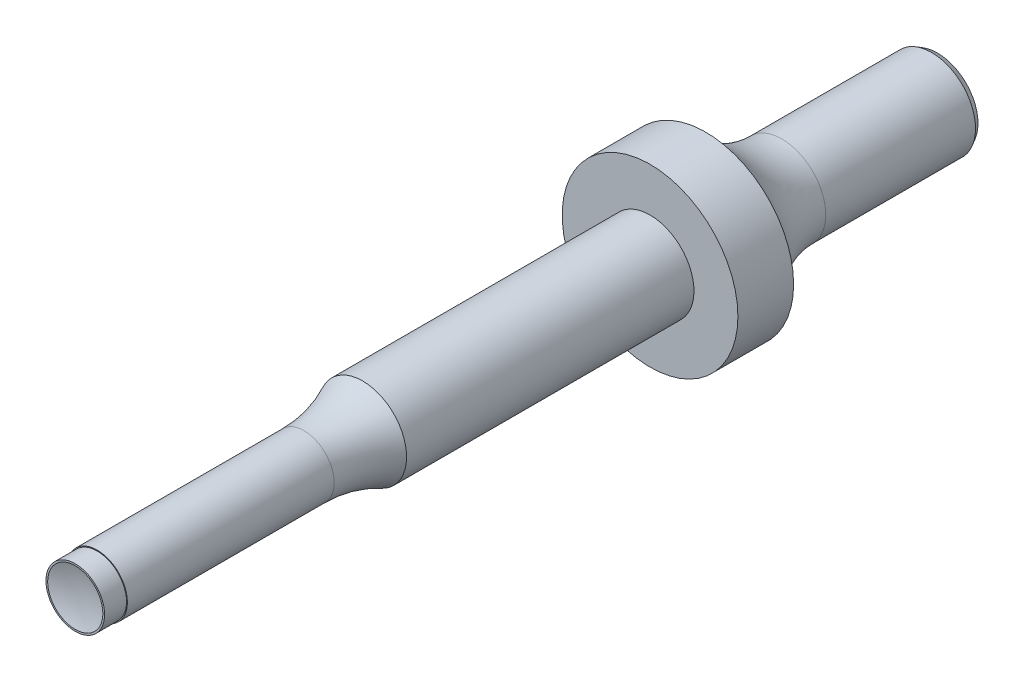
ISO-10303-21;
HEADER;
FILE_DESCRIPTION(('STEP AP214'),'2;1');
FILE_NAME('part.step','',(''),(''),'','','');
FILE_SCHEMA(('AUTOMOTIVE_DESIGN { 1 0 10303 214 1 1 1 1 }'));
ENDSEC;
DATA;
#1=APPLICATION_CONTEXT('core data for automotive mechanical design processes');
#2=APPLICATION_PROTOCOL_DEFINITION('international standard','automotive_design',2000,#1);
#3=PRODUCT_CONTEXT('',#1,'mechanical');
#4=PRODUCT('Part','Part','',(#3));
#5=PRODUCT_RELATED_PRODUCT_CATEGORY('part','',(#4));
#6=PRODUCT_DEFINITION_FORMATION('','',#4);
#7=PRODUCT_DEFINITION_CONTEXT('part definition',#1,'design');
#8=PRODUCT_DEFINITION('design','',#6,#7);
#9=PRODUCT_DEFINITION_SHAPE('','',#8);
#10=(LENGTH_UNIT() NAMED_UNIT(*) SI_UNIT(.MILLI.,.METRE.));
#11=(NAMED_UNIT(*) PLANE_ANGLE_UNIT() SI_UNIT($,.RADIAN.));
#12=(NAMED_UNIT(*) SI_UNIT($,.STERADIAN.) SOLID_ANGLE_UNIT());
#13=UNCERTAINTY_MEASURE_WITH_UNIT(LENGTH_MEASURE(1.E-05),#10,'distance_accuracy_value','');
#14=(GEOMETRIC_REPRESENTATION_CONTEXT(3) GLOBAL_UNCERTAINTY_ASSIGNED_CONTEXT((#13)) GLOBAL_UNIT_ASSIGNED_CONTEXT((#10,
#11,#12)) REPRESENTATION_CONTEXT('',''));
#15=CARTESIAN_POINT('',(0.,0.,0.));
#16=DIRECTION('',(0.,0.,1.));
#17=DIRECTION('',(1.,0.,0.));
#18=AXIS2_PLACEMENT_3D('',#15,#16,#17);
#19=CARTESIAN_POINT('',(0.,0.,-100.));
#20=DIRECTION('',(0.,0.,1.));
#21=DIRECTION('',(1.,0.,0.));
#22=AXIS2_PLACEMENT_3D('',#19,#20,#21);
#23=CYLINDRICAL_SURFACE('',#22,5.095);
#24=CARTESIAN_POINT('',(0.,0.,-33.3333333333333));
#25=DIRECTION('',(0.,0.,-1.));
#26=DIRECTION('',(0.,1.,0.));
#27=AXIS2_PLACEMENT_3D('',#24,#25,#26);
#28=CIRCLE('',#27,5.095);
#29=CARTESIAN_POINT('',(0.,5.095,-33.3333333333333));
#30=VERTEX_POINT('',#29);
#31=EDGE_CURVE('E76',#30,#30,#28,.T.);
#32=ORIENTED_EDGE('',*,*,#31,.T.);
#33=EDGE_LOOP('',(#32));
#34=FACE_BOUND('',#33,.T.);
#35=CARTESIAN_POINT('',(0.,0.,-66.6666666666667));
#36=DIRECTION('',(0.,0.,-1.));
#37=DIRECTION('',(-1.,0.,0.));
#38=AXIS2_PLACEMENT_3D('',#35,#36,#37);
#39=CIRCLE('',#38,5.095);
#40=CARTESIAN_POINT('',(-5.095,0.,-66.6666666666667));
#41=VERTEX_POINT('',#40);
#42=EDGE_CURVE('E44',#41,#41,#39,.F.);
#43=ORIENTED_EDGE('',*,*,#42,.T.);
#44=EDGE_LOOP('',(#43));
#45=FACE_BOUND('',#44,.T.);
#46=ADVANCED_FACE('F40',(#34,#45),#23,.T.);
#47=CARTESIAN_POINT('',(0.,0.,-33.3333333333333));
#48=DIRECTION('',(0.,0.,1.));
#49=DIRECTION('',(1.,0.,0.));
#50=AXIS2_PLACEMENT_3D('',#47,#48,#49);
#51=CYLINDRICAL_SURFACE('',#50,3.5);
#52=CARTESIAN_POINT('',(0.,0.,-26.5351626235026));
#53=DIRECTION('',(0.,0.,1.));
#54=DIRECTION('',(0.,-1.,0.));
#55=AXIS2_PLACEMENT_3D('',#52,#53,#54);
#56=CIRCLE('',#55,3.5);
#57=CARTESIAN_POINT('',(0.,-3.5,-26.5351626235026));
#58=VERTEX_POINT('',#57);
#59=EDGE_CURVE('E12',#58,#58,#56,.F.);
#60=ORIENTED_EDGE('',*,*,#59,.F.);
#61=EDGE_LOOP('',(#60));
#62=FACE_BOUND('',#61,.T.);
#63=CARTESIAN_POINT('',(0.,0.,-2.5475));
#64=DIRECTION('',(0.,0.,1.));
#65=DIRECTION('',(1.,0.,0.));
#66=AXIS2_PLACEMENT_3D('',#63,#64,#65);
#67=CIRCLE('',#66,3.5);
#68=CARTESIAN_POINT('',(3.5,0.,-2.5475));
#69=VERTEX_POINT('',#68);
#70=EDGE_CURVE('E60',#69,#69,#67,.F.);
#71=ORIENTED_EDGE('',*,*,#70,.T.);
#72=EDGE_LOOP('',(#71));
#73=FACE_BOUND('',#72,.T.);
#74=ADVANCED_FACE('F105',(#62,#73),#51,.T.);
#75=CARTESIAN_POINT('',(0.,0.,-2.5475));
#76=DIRECTION('',(0.,0.,1.));
#77=DIRECTION('',(1.,0.,0.));
#78=AXIS2_PLACEMENT_3D('',#75,#76,#77);
#79=PLANE('',#78);
#80=ORIENTED_EDGE('',*,*,#70,.F.);
#81=EDGE_LOOP('',(#80));
#82=FACE_BOUND('',#81,.T.);
#83=CARTESIAN_POINT('',(0.,0.,-2.5475));
#84=DIRECTION('',(0.,0.,1.));
#85=DIRECTION('',(1.,0.,0.));
#86=AXIS2_PLACEMENT_3D('',#83,#84,#85);
#87=CIRCLE('',#86,3.4);
#88=CARTESIAN_POINT('',(3.4,0.,-2.5475));
#89=VERTEX_POINT('',#88);
#90=EDGE_CURVE('E64',#89,#89,#87,.T.);
#91=ORIENTED_EDGE('',*,*,#90,.F.);
#92=EDGE_LOOP('',(#91));
#93=FACE_BOUND('',#92,.T.);
#94=ADVANCED_FACE('F110',(#82,#93),#79,.T.);
#95=CARTESIAN_POINT('',(0.,0.,-2.5475));
#96=DIRECTION('',(0.,0.,1.));
#97=DIRECTION('',(1.,0.,0.));
#98=AXIS2_PLACEMENT_3D('',#95,#96,#97);
#99=CYLINDRICAL_SURFACE('',#98,3.4);
#100=CARTESIAN_POINT('',(0.,0.,0.));
#101=DIRECTION('',(0.,0.,1.));
#102=DIRECTION('',(1.,0.,0.));
#103=AXIS2_PLACEMENT_3D('',#100,#101,#102);
#104=CIRCLE('',#103,3.4);
#105=CARTESIAN_POINT('',(3.4,0.,0.));
#106=VERTEX_POINT('',#105);
#107=EDGE_CURVE('E65',#106,#106,#104,.T.);
#108=CARTESIAN_POINT('',(3.4,0.,-2.5475));
#109=CARTESIAN_POINT('',(3.4,0.,-2.52096354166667));
#110=CARTESIAN_POINT('',(3.4,0.,-2.49442708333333));
#111=CARTESIAN_POINT('',(3.4,0.,-2.44135416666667));
#112=CARTESIAN_POINT('',(3.4,0.,-2.41481770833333));
#113=CARTESIAN_POINT('',(3.4,0.,-2.36174479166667));
#114=CARTESIAN_POINT('',(3.4,0.,-2.33520833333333));
#115=CARTESIAN_POINT('',(3.4,0.,-2.28213541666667));
#116=CARTESIAN_POINT('',(3.4,0.,-2.25559895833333));
#117=CARTESIAN_POINT('',(3.4,0.,-2.20252604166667));
#118=CARTESIAN_POINT('',(3.4,0.,-2.17598958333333));
#119=CARTESIAN_POINT('',(3.4,0.,-2.12291666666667));
#120=CARTESIAN_POINT('',(3.4,0.,-2.09638020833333));
#121=CARTESIAN_POINT('',(3.4,0.,-2.04330729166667));
#122=CARTESIAN_POINT('',(3.4,0.,-2.01677083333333));
#123=CARTESIAN_POINT('',(3.4,0.,-1.96369791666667));
#124=CARTESIAN_POINT('',(3.4,0.,-1.93716145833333));
#125=CARTESIAN_POINT('',(3.4,0.,-1.88408854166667));
#126=CARTESIAN_POINT('',(3.4,0.,-1.85755208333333));
#127=CARTESIAN_POINT('',(3.4,0.,-1.80447916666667));
#128=CARTESIAN_POINT('',(3.4,0.,-1.77794270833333));
#129=CARTESIAN_POINT('',(3.4,0.,-1.72486979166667));
#130=CARTESIAN_POINT('',(3.4,0.,-1.69833333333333));
#131=CARTESIAN_POINT('',(3.4,0.,-1.64526041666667));
#132=CARTESIAN_POINT('',(3.4,0.,-1.61872395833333));
#133=CARTESIAN_POINT('',(3.4,0.,-1.56565104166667));
#134=CARTESIAN_POINT('',(3.4,0.,-1.53911458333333));
#135=CARTESIAN_POINT('',(3.4,0.,-1.48604166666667));
#136=CARTESIAN_POINT('',(3.4,0.,-1.45950520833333));
#137=CARTESIAN_POINT('',(3.4,0.,-1.40643229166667));
#138=CARTESIAN_POINT('',(3.4,0.,-1.37989583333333));
#139=CARTESIAN_POINT('',(3.4,0.,-1.32682291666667));
#140=CARTESIAN_POINT('',(3.4,0.,-1.30028645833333));
#141=CARTESIAN_POINT('',(3.4,0.,-1.24721354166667));
#142=CARTESIAN_POINT('',(3.4,0.,-1.22067708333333));
#143=CARTESIAN_POINT('',(3.4,0.,-1.16760416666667));
#144=CARTESIAN_POINT('',(3.4,0.,-1.14106770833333));
#145=CARTESIAN_POINT('',(3.4,0.,-1.08799479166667));
#146=CARTESIAN_POINT('',(3.4,0.,-1.06145833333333));
#147=CARTESIAN_POINT('',(3.4,0.,-1.00838541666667));
#148=CARTESIAN_POINT('',(3.4,0.,-0.981848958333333));
#149=CARTESIAN_POINT('',(3.4,0.,-0.928776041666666));
#150=CARTESIAN_POINT('',(3.4,0.,-0.902239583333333));
#151=CARTESIAN_POINT('',(3.4,0.,-0.849166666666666));
#152=CARTESIAN_POINT('',(3.4,0.,-0.822630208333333));
#153=CARTESIAN_POINT('',(3.4,0.,-0.769557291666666));
#154=CARTESIAN_POINT('',(3.4,0.,-0.743020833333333));
#155=CARTESIAN_POINT('',(3.4,0.,-0.689947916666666));
#156=CARTESIAN_POINT('',(3.4,0.,-0.663411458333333));
#157=CARTESIAN_POINT('',(3.4,0.,-0.610338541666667));
#158=CARTESIAN_POINT('',(3.4,0.,-0.583802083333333));
#159=CARTESIAN_POINT('',(3.4,0.,-0.530729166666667));
#160=CARTESIAN_POINT('',(3.4,0.,-0.504192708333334));
#161=CARTESIAN_POINT('',(3.4,0.,-0.451119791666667));
#162=CARTESIAN_POINT('',(3.4,0.,-0.424583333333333));
#163=CARTESIAN_POINT('',(3.4,0.,-0.371510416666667));
#164=CARTESIAN_POINT('',(3.4,0.,-0.344973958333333));
#165=CARTESIAN_POINT('',(3.4,0.,-0.291901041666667));
#166=CARTESIAN_POINT('',(3.4,0.,-0.265364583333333));
#167=CARTESIAN_POINT('',(3.4,0.,-0.212291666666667));
#168=CARTESIAN_POINT('',(3.4,0.,-0.185755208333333));
#169=CARTESIAN_POINT('',(3.4,0.,-0.132682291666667));
#170=CARTESIAN_POINT('',(3.4,0.,-0.106145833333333));
#171=CARTESIAN_POINT('',(3.4,0.,-0.0530729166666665));
#172=CARTESIAN_POINT('',(3.4,0.,-0.0265364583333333));
#173=CARTESIAN_POINT('',(3.4,0.,0.));
#174=B_SPLINE_CURVE_WITH_KNOTS('',3,(#108,#109,#110,#111,#112,#113,#114,#115,#116,#117,#118,
#119,#120,#121,#122,#123,#124,#125,#126,#127,#128,#129,#130,#131,#132,#133,#134,#135,#136,#137,
#138,#139,#140,#141,#142,#143,#144,#145,#146,#147,#148,#149,#150,#151,#152,#153,#154,#155,#156,
#157,#158,#159,#160,#161,#162,#163,#164,#165,#166,#167,#168,#169,#170,#171,#172,#173),
.UNSPECIFIED.,.F.,.F.,(4,2,2,2,2,2,2,2,2,2,2,2,2,2,2,2,2,2,2,2,2,2,2,2,2,2,2,2,2,2,2,2,4),(0.,
0.0796093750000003,0.15921875,0.238828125,0.3184375,0.398046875,0.47765625,0.557265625,0.636875,
0.716484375,0.79609375,0.875703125,0.9553125,1.034921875,1.11453125,1.194140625,1.27375,
1.353359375,1.43296875,1.512578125,1.5921875,1.671796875,1.75140625,1.831015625,1.910625,
1.990234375,2.06984375,2.149453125,2.2290625,2.308671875,2.38828125,2.467890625,2.5475),.UNSPECIFIED.);
#175=EDGE_CURVE('BSEAM147',#89,#106,#174,.T.);
#176=ORIENTED_EDGE('',*,*,#90,.T.);
#177=ORIENTED_EDGE('',*,*,#107,.F.);
#178=ORIENTED_EDGE('',*,*,#175,.T.);
#179=ORIENTED_EDGE('',*,*,#175,.F.);
#180=EDGE_LOOP('',(#176,#178,#177,#179));
#181=FACE_BOUND('',#180,.T.);
#182=ADVANCED_FACE('F147',(#181),#99,.T.);
#183=CARTESIAN_POINT('',(0.,0.,0.));
#184=DIRECTION('',(0.,0.,1.));
#185=DIRECTION('',(1.,0.,0.));
#186=AXIS2_PLACEMENT_3D('',#183,#184,#185);
#187=PLANE('',#186);
#188=CARTESIAN_POINT('',(0.,0.,0.));
#189=DIRECTION('',(0.,0.,1.));
#190=DIRECTION('',(0.,-1.,0.));
#191=AXIS2_PLACEMENT_3D('',#188,#189,#190);
#192=CIRCLE('',#191,3.2);
#193=CARTESIAN_POINT('',(0.,-3.2,0.));
#194=VERTEX_POINT('',#193);
#195=EDGE_CURVE('E69',#194,#194,#192,.T.);
#196=ORIENTED_EDGE('',*,*,#195,.F.);
#197=EDGE_LOOP('',(#196));
#198=FACE_BOUND('',#197,.T.);
#199=ORIENTED_EDGE('',*,*,#107,.T.);
#200=EDGE_LOOP('',(#199));
#201=FACE_BOUND('',#200,.T.);
#202=ADVANCED_FACE('F145',(#198,#201),#187,.T.);
#203=CARTESIAN_POINT('',(0.,0.,9.67450773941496));
#204=DIRECTION('',(0.,0.,1.));
#205=DIRECTION('',(0.,-1.,0.));
#206=AXIS2_PLACEMENT_3D('',#203,#204,#205);
#207=SPHERICAL_SURFACE('',#206,10.19);
#208=ORIENTED_EDGE('',*,*,#195,.T.);
#209=EDGE_LOOP('',(#208));
#210=FACE_BOUND('',#209,.T.);
#211=ADVANCED_FACE('F142',(#210),#207,.F.);
#212=CARTESIAN_POINT('',(0.,0.,-26.5351626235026));
#213=DIRECTION('',(0.,0.,-1.));
#214=DIRECTION('',(0.,1.,0.));
#215=AXIS2_PLACEMENT_3D('',#212,#213,#214);
#216=TOROIDAL_SURFACE('',#215,18.785,15.285);
#217=ORIENTED_EDGE('',*,*,#59,.T.);
#218=EDGE_LOOP('',(#217));
#219=FACE_BOUND('',#218,.T.);
#220=ORIENTED_EDGE('',*,*,#31,.F.);
#221=EDGE_LOOP('',(#220));
#222=FACE_BOUND('',#221,.T.);
#223=ADVANCED_FACE('F123',(#219,#222),#216,.F.);
#224=CARTESIAN_POINT('',(0.,0.,-66.6666666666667));
#225=DIRECTION('',(0.,0.,-1.));
#226=DIRECTION('',(-1.,0.,0.));
#227=AXIS2_PLACEMENT_3D('',#224,#225,#226);
#228=PLANE('',#227);
#229=ORIENTED_EDGE('',*,*,#42,.F.);
#230=EDGE_LOOP('',(#229));
#231=FACE_BOUND('',#230,.T.);
#232=CARTESIAN_POINT('',(0.,0.,-66.6666666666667));
#233=DIRECTION('',(0.,0.,1.));
#234=DIRECTION('',(1.,0.,0.));
#235=AXIS2_PLACEMENT_3D('',#232,#233,#234);
#236=CIRCLE('',#235,10.19);
#237=CARTESIAN_POINT('',(10.19,0.,-66.6666666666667));
#238=VERTEX_POINT('',#237);
#239=EDGE_CURVE('E80',#238,#238,#236,.T.);
#240=ORIENTED_EDGE('',*,*,#239,.T.);
#241=EDGE_LOOP('',(#240));
#242=FACE_BOUND('',#241,.T.);
#243=ADVANCED_FACE('F119',(#231,#242),#228,.F.);
#244=CARTESIAN_POINT('',(0.,0.,-66.6666666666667));
#245=DIRECTION('',(0.,0.,1.));
#246=DIRECTION('',(1.,0.,0.));
#247=AXIS2_PLACEMENT_3D('',#244,#245,#246);
#248=CYLINDRICAL_SURFACE('',#247,10.19);
#249=ORIENTED_EDGE('',*,*,#239,.F.);
#250=EDGE_LOOP('',(#249));
#251=FACE_BOUND('',#250,.T.);
#252=CARTESIAN_POINT('',(0.,0.,-73.1268678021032));
#253=DIRECTION('',(0.,0.,1.));
#254=DIRECTION('',(1.,0.,0.));
#255=AXIS2_PLACEMENT_3D('',#252,#253,#254);
#256=CIRCLE('',#255,10.19);
#257=CARTESIAN_POINT('',(10.19,0.,-73.1268678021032));
#258=VERTEX_POINT('',#257);
#259=EDGE_CURVE('E84',#258,#258,#256,.T.);
#260=ORIENTED_EDGE('',*,*,#259,.T.);
#261=EDGE_LOOP('',(#260));
#262=FACE_BOUND('',#261,.T.);
#263=ADVANCED_FACE('F122',(#251,#262),#248,.T.);
#264=CARTESIAN_POINT('',(0.,0.,-81.9516666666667));
#265=DIRECTION('',(0.,0.,1.));
#266=DIRECTION('',(1.,0.,0.));
#267=AXIS2_PLACEMENT_3D('',#264,#265,#266);
#268=TOROIDAL_SURFACE('',#267,15.285,10.19);
#269=ORIENTED_EDGE('',*,*,#259,.F.);
#270=EDGE_LOOP('',(#269));
#271=FACE_BOUND('',#270,.T.);
#272=CARTESIAN_POINT('',(0.,0.,-81.9516666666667));
#273=DIRECTION('',(0.,0.,1.));
#274=DIRECTION('',(1.,0.,0.));
#275=AXIS2_PLACEMENT_3D('',#272,#273,#274);
#276=CIRCLE('',#275,5.095);
#277=CARTESIAN_POINT('',(5.095,0.,-81.9516666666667));
#278=VERTEX_POINT('',#277);
#279=EDGE_CURVE('E88',#278,#278,#276,.T.);
#280=ORIENTED_EDGE('',*,*,#279,.T.);
#281=EDGE_LOOP('',(#280));
#282=FACE_BOUND('',#281,.T.);
#283=ADVANCED_FACE('F93',(#271,#282),#268,.F.);
#284=CARTESIAN_POINT('',(0.,0.,-100.));
#285=DIRECTION('',(0.,0.,1.));
#286=DIRECTION('',(1.,0.,0.));
#287=AXIS2_PLACEMENT_3D('',#284,#285,#286);
#288=PLANE('',#287);
#289=CARTESIAN_POINT('',(0.,0.,-100.));
#290=DIRECTION('',(0.,0.,1.));
#291=DIRECTION('',(1.,0.,0.));
#292=AXIS2_PLACEMENT_3D('',#289,#290,#291);
#293=CIRCLE('',#292,4.70278671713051);
#294=CARTESIAN_POINT('',(4.70278671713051,0.,-100.));
#295=VERTEX_POINT('',#294);
#296=EDGE_CURVE('E49',#295,#295,#293,.F.);
#297=ORIENTED_EDGE('',*,*,#296,.T.);
#298=EDGE_LOOP('',(#297));
#299=FACE_BOUND('',#298,.T.);
#300=ADVANCED_FACE('F101',(#299),#288,.F.);
#301=CARTESIAN_POINT('',(0.,0.,-99.3206666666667));
#302=DIRECTION('',(0.,0.,1.));
#303=DIRECTION('',(1.,0.,0.));
#304=AXIS2_PLACEMENT_3D('',#301,#302,#303);
#305=CONICAL_SURFACE('',#304,5.095,0.523598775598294);
#306=ORIENTED_EDGE('',*,*,#296,.F.);
#307=EDGE_LOOP('',(#306));
#308=FACE_BOUND('',#307,.T.);
#309=CARTESIAN_POINT('',(0.,0.,-99.3206666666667));
#310=DIRECTION('',(0.,0.,1.));
#311=DIRECTION('',(1.,0.,0.));
#312=AXIS2_PLACEMENT_3D('',#309,#310,#311);
#313=CIRCLE('',#312,5.095);
#314=CARTESIAN_POINT('',(5.095,0.,-99.3206666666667));
#315=VERTEX_POINT('',#314);
#316=EDGE_CURVE('E54',#315,#315,#313,.T.);
#317=ORIENTED_EDGE('',*,*,#316,.F.);
#318=EDGE_LOOP('',(#317));
#319=FACE_BOUND('',#318,.T.);
#320=ADVANCED_FACE('F42',(#308,#319),#305,.T.);
#321=ORIENTED_EDGE('',*,*,#316,.T.);
#322=EDGE_LOOP('',(#321));
#323=FACE_BOUND('',#322,.T.);
#324=ORIENTED_EDGE('',*,*,#279,.F.);
#325=EDGE_LOOP('',(#324));
#326=FACE_BOUND('',#325,.T.);
#327=ADVANCED_FACE('F95',(#323,#326),#23,.T.);
#328=CLOSED_SHELL('',(#46,#74,#94,#182,#202,#211,#223,#243,#263,#283,#300,#320,#327));
#329=MANIFOLD_SOLID_BREP('B2',#328);
#330=ADVANCED_BREP_SHAPE_REPRESENTATION('',(#18,#329),#14);
#331=SHAPE_DEFINITION_REPRESENTATION(#9,#330);
ENDSEC;
END-ISO-10303-21;
